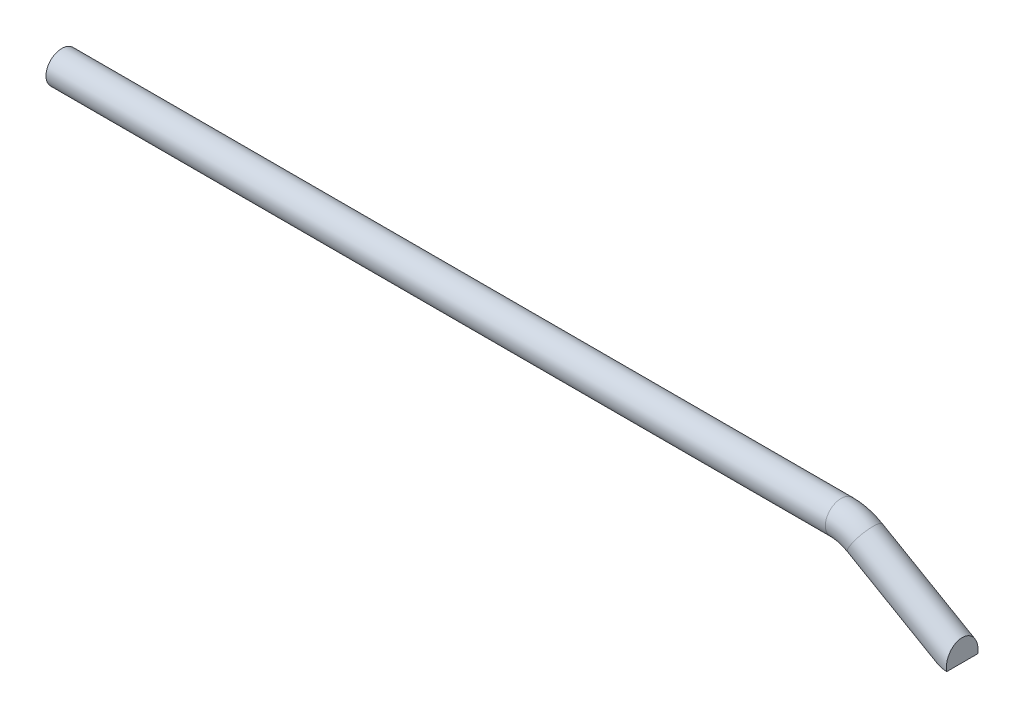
ISO-10303-21;
HEADER;
FILE_DESCRIPTION(('STEP AP214'),'2;1');
FILE_NAME('part.step','',(''),(''),'','','');
FILE_SCHEMA(('AUTOMOTIVE_DESIGN { 1 0 10303 214 1 1 1 1 }'));
ENDSEC;
DATA;
#1=APPLICATION_CONTEXT('core data for automotive mechanical design processes');
#2=APPLICATION_PROTOCOL_DEFINITION('international standard','automotive_design',2000,#1);
#3=PRODUCT_CONTEXT('',#1,'mechanical');
#4=PRODUCT('Part','Part','',(#3));
#5=PRODUCT_RELATED_PRODUCT_CATEGORY('part','',(#4));
#6=PRODUCT_DEFINITION_FORMATION('','',#4);
#7=PRODUCT_DEFINITION_CONTEXT('part definition',#1,'design');
#8=PRODUCT_DEFINITION('design','',#6,#7);
#9=PRODUCT_DEFINITION_SHAPE('','',#8);
#10=(LENGTH_UNIT() NAMED_UNIT(*) SI_UNIT(.MILLI.,.METRE.));
#11=(NAMED_UNIT(*) PLANE_ANGLE_UNIT() SI_UNIT($,.RADIAN.));
#12=(NAMED_UNIT(*) SI_UNIT($,.STERADIAN.) SOLID_ANGLE_UNIT());
#13=UNCERTAINTY_MEASURE_WITH_UNIT(LENGTH_MEASURE(1.E-05),#10,'distance_accuracy_value','');
#14=(GEOMETRIC_REPRESENTATION_CONTEXT(3) GLOBAL_UNCERTAINTY_ASSIGNED_CONTEXT((#13)) GLOBAL_UNIT_ASSIGNED_CONTEXT((#10,
#11,#12)) REPRESENTATION_CONTEXT('',''));
#15=CARTESIAN_POINT('',(0.,0.,0.));
#16=DIRECTION('',(0.,0.,1.));
#17=DIRECTION('',(1.,0.,0.));
#18=AXIS2_PLACEMENT_3D('',#15,#16,#17);
#19=CARTESIAN_POINT('',(304.17691453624,-2.41154273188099,-4.44089209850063E-13));
#20=DIRECTION('',(0.86602540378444,-0.5,0.));
#21=DIRECTION('',(0.499999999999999,0.866025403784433,0.));
#22=AXIS2_PLACEMENT_3D('',#19,#20,#21);
#23=CYLINDRICAL_SURFACE('',#22,6.);
#24=CARTESIAN_POINT('',(341.,-23.6713610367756,-4.71844785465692E-13));
#25=DIRECTION('',(-1.,0.,0.));
#26=DIRECTION('',(0.,-0.999999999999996,0.));
#27=AXIS2_PLACEMENT_3D('',#24,#25,#26);
#28=ELLIPSE('',#27,6.92820323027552,6.);
#29=CARTESIAN_POINT('',(341.,-25.0000000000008,-5.88863641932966));
#30=VERTEX_POINT('',#29);
#31=CARTESIAN_POINT('',(341.,-25.0000000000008,5.88863641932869));
#32=VERTEX_POINT('',#31);
#33=EDGE_CURVE('E48',#30,#32,#28,.F.);
#34=ORIENTED_EDGE('',*,*,#33,.F.);
#35=CARTESIAN_POINT('',(343.301270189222,-25.0000000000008,-4.71844785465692E-13));
#36=DIRECTION('',(0.,0.999999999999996,0.));
#37=DIRECTION('',(1.,0.,0.));
#38=AXIS2_PLACEMENT_3D('',#35,#36,#37);
#39=ELLIPSE('',#38,12.,6.);
#40=EDGE_CURVE('E11',#32,#30,#39,.F.);
#41=ORIENTED_EDGE('',*,*,#40,.F.);
#42=EDGE_LOOP('',(#34,#41));
#43=FACE_BOUND('',#42,.T.);
#44=CARTESIAN_POINT('',(304.17691453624,-2.41154273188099,-4.44089209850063E-13));
#45=DIRECTION('',(0.866025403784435,-0.500000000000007,0.));
#46=DIRECTION('',(0.,0.,-1.));
#47=AXIS2_PLACEMENT_3D('',#44,#45,#46);
#48=CIRCLE('',#47,6.);
#49=CARTESIAN_POINT('',(307.17691453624,2.78460969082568,-4.44089209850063E-13));
#50=VERTEX_POINT('',#49);
#51=EDGE_CURVE('E62',#50,#50,#48,.T.);
#52=ORIENTED_EDGE('',*,*,#51,.T.);
#53=EDGE_LOOP('',(#52));
#54=FACE_BOUND('',#53,.T.);
#55=ADVANCED_FACE('F40',(#43,#54),#23,.T.);
#56=CARTESIAN_POINT('',(295.17691453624,-18.0000000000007,-4.44089209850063E-13));
#57=DIRECTION('',(0.,0.,-1.));
#58=DIRECTION('',(-1.,0.,0.));
#59=AXIS2_PLACEMENT_3D('',#56,#57,#58);
#60=TOROIDAL_SURFACE('',#59,18.,6.);
#61=CARTESIAN_POINT('',(295.17691453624,-8.32667268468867E-13,-4.44089209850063E-13));
#62=DIRECTION('',(1.,0.,0.));
#63=DIRECTION('',(0.,0.,-1.));
#64=AXIS2_PLACEMENT_3D('',#61,#62,#63);
#65=CIRCLE('',#64,6.);
#66=CARTESIAN_POINT('',(295.17691453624,5.99999999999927,-4.44089209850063E-13));
#67=VERTEX_POINT('',#66);
#68=EDGE_CURVE('E69',#67,#67,#65,.T.);
#69=CARTESIAN_POINT('',(295.17691453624,-18.0000000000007,-4.44089209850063E-13));
#70=DIRECTION('',(0.,0.,-1.));
#71=DIRECTION('',(-1.,0.,0.));
#72=AXIS2_PLACEMENT_3D('',#69,#70,#71);
#73=CIRCLE('',#72,24.);
#74=EDGE_CURVE('',#67,#50,#73,.T.);
#75=ORIENTED_EDGE('',*,*,#68,.T.);
#76=ORIENTED_EDGE('',*,*,#51,.F.);
#77=ORIENTED_EDGE('',*,*,#74,.T.);
#78=ORIENTED_EDGE('',*,*,#74,.F.);
#79=EDGE_LOOP('',(#75,#77,#76,#78));
#80=FACE_BOUND('',#79,.T.);
#81=ADVANCED_FACE('F79',(#80),#60,.T.);
#82=CARTESIAN_POINT('',(295.17691453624,-8.32667268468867E-13,-4.44089209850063E-13));
#83=DIRECTION('',(-1.,0.,0.));
#84=DIRECTION('',(0.,0.,1.));
#85=AXIS2_PLACEMENT_3D('',#82,#83,#84);
#86=CYLINDRICAL_SURFACE('',#85,6.);
#87=ORIENTED_EDGE('',*,*,#68,.F.);
#88=EDGE_LOOP('',(#87));
#89=FACE_BOUND('',#88,.T.);
#90=CARTESIAN_POINT('',(0.,0.,0.));
#91=DIRECTION('',(1.,0.,0.));
#92=DIRECTION('',(0.,0.,-1.));
#93=AXIS2_PLACEMENT_3D('',#90,#91,#92);
#94=CIRCLE('',#93,6.);
#95=CARTESIAN_POINT('',(0.,0.,-6.));
#96=VERTEX_POINT('',#95);
#97=EDGE_CURVE('E65',#96,#96,#94,.T.);
#98=ORIENTED_EDGE('',*,*,#97,.T.);
#99=EDGE_LOOP('',(#98));
#100=FACE_BOUND('',#99,.T.);
#101=ADVANCED_FACE('F81',(#89,#100),#86,.T.);
#102=CARTESIAN_POINT('',(0.,0.,0.));
#103=DIRECTION('',(1.,0.,0.));
#104=DIRECTION('',(0.,0.,-1.));
#105=AXIS2_PLACEMENT_3D('',#102,#103,#104);
#106=PLANE('',#105);
#107=ORIENTED_EDGE('',*,*,#97,.F.);
#108=EDGE_LOOP('',(#107));
#109=FACE_BOUND('',#108,.T.);
#110=ADVANCED_FACE('F87',(#109),#106,.F.);
#111=CARTESIAN_POINT('',(331.301270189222,-25.0000000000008,-10.0000000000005));
#112=DIRECTION('',(0.,0.999999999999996,0.));
#113=DIRECTION('',(0.,0.,1.));
#114=AXIS2_PLACEMENT_3D('',#111,#112,#113);
#115=PLANE('',#114);
#116=ORIENTED_EDGE('',*,*,#40,.T.);
#117=DIRECTION('',(0.,0.,1.));
#118=VECTOR('',#117,1.);
#119=CARTESIAN_POINT('',(341.,-25.0000000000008,-10.0000000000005));
#120=LINE('',#119,#118);
#121=EDGE_CURVE('E58',#30,#32,#120,.T.);
#122=ORIENTED_EDGE('',*,*,#121,.T.);
#123=EDGE_LOOP('',(#116,#122));
#124=FACE_BOUND('',#123,.T.);
#125=ADVANCED_FACE('F57',(#124),#115,.F.);
#126=CARTESIAN_POINT('',(341.,-25.0000000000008,-10.0000000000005));
#127=DIRECTION('',(-1.,0.,0.));
#128=DIRECTION('',(0.,0.,1.));
#129=AXIS2_PLACEMENT_3D('',#126,#127,#128);
#130=PLANE('',#129);
#131=ORIENTED_EDGE('',*,*,#121,.F.);
#132=ORIENTED_EDGE('',*,*,#33,.T.);
#133=EDGE_LOOP('',(#131,#132));
#134=FACE_BOUND('',#133,.T.);
#135=ADVANCED_FACE('F63',(#134),#130,.F.);
#136=CLOSED_SHELL('',(#55,#81,#101,#110,#125,#135));
#137=MANIFOLD_SOLID_BREP('B2',#136);
#138=ADVANCED_BREP_SHAPE_REPRESENTATION('',(#18,#137),#14);
#139=SHAPE_DEFINITION_REPRESENTATION(#9,#138);
ENDSEC;
END-ISO-10303-21;
